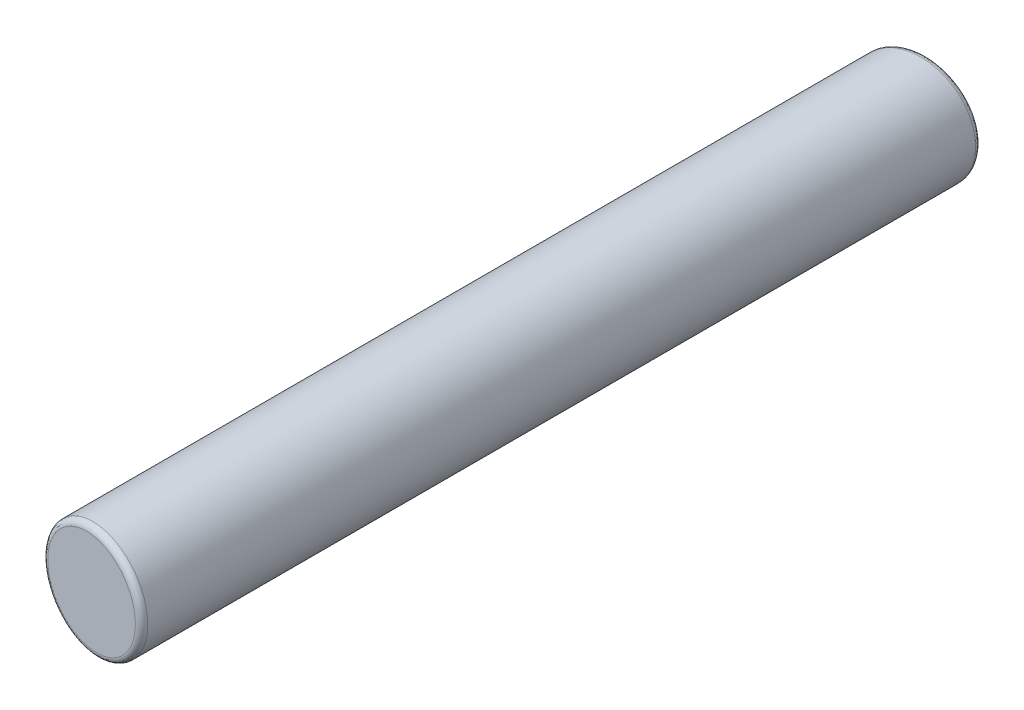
ISO-10303-21;
HEADER;
FILE_DESCRIPTION(('STEP AP214'),'2;1');
FILE_NAME('part.step','',(''),(''),'','','');
FILE_SCHEMA(('AUTOMOTIVE_DESIGN { 1 0 10303 214 1 1 1 1 }'));
ENDSEC;
DATA;
#1=APPLICATION_CONTEXT('core data for automotive mechanical design processes');
#2=APPLICATION_PROTOCOL_DEFINITION('international standard','automotive_design',2000,#1);
#3=PRODUCT_CONTEXT('',#1,'mechanical');
#4=PRODUCT('Part','Part','',(#3));
#5=PRODUCT_RELATED_PRODUCT_CATEGORY('part','',(#4));
#6=PRODUCT_DEFINITION_FORMATION('','',#4);
#7=PRODUCT_DEFINITION_CONTEXT('part definition',#1,'design');
#8=PRODUCT_DEFINITION('design','',#6,#7);
#9=PRODUCT_DEFINITION_SHAPE('','',#8);
#10=(LENGTH_UNIT() NAMED_UNIT(*) SI_UNIT(.MILLI.,.METRE.));
#11=(NAMED_UNIT(*) PLANE_ANGLE_UNIT() SI_UNIT($,.RADIAN.));
#12=(NAMED_UNIT(*) SI_UNIT($,.STERADIAN.) SOLID_ANGLE_UNIT());
#13=UNCERTAINTY_MEASURE_WITH_UNIT(LENGTH_MEASURE(1.E-05),#10,'distance_accuracy_value','');
#14=(GEOMETRIC_REPRESENTATION_CONTEXT(3) GLOBAL_UNCERTAINTY_ASSIGNED_CONTEXT((#13)) GLOBAL_UNIT_ASSIGNED_CONTEXT((#10,
#11,#12)) REPRESENTATION_CONTEXT('',''));
#15=CARTESIAN_POINT('',(0.,0.,0.));
#16=DIRECTION('',(0.,0.,1.));
#17=DIRECTION('',(1.,0.,0.));
#18=AXIS2_PLACEMENT_3D('',#15,#16,#17);
#19=CARTESIAN_POINT('',(0.,0.,18.2372));
#20=DIRECTION('',(0.,0.,-1.));
#21=DIRECTION('',(-1.,0.,0.));
#22=AXIS2_PLACEMENT_3D('',#19,#20,#21);
#23=CYLINDRICAL_SURFACE('',#22,1.2065);
#24=CARTESIAN_POINT('',(0.,0.,17.9641832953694));
#25=DIRECTION('',(-0.106989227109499,0.,0.994260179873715));
#26=DIRECTION('',(-0.994260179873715,0.,-0.106989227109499));
#27=AXIS2_PLACEMENT_3D('',#24,#25,#26);
#28=ELLIPSE('',#27,1.21346507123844,1.2065);
#29=CARTESIAN_POINT('',(-1.2065,0.,17.8343556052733));
#30=VERTEX_POINT('',#29);
#31=EDGE_CURVE('E49',#30,#30,#28,.F.);
#32=ORIENTED_EDGE('',*,*,#31,.T.);
#33=EDGE_LOOP('',(#32));
#34=FACE_BOUND('',#33,.T.);
#35=CARTESIAN_POINT('',(0.,0.,0.267548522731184));
#36=DIRECTION('',(-0.103049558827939,0.,-0.994676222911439));
#37=DIRECTION('',(0.994676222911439,0.,-0.103049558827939));
#38=AXIS2_PLACEMENT_3D('',#35,#36,#37);
#39=ELLIPSE('',#38,1.21295751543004,1.2065);
#40=CARTESIAN_POINT('',(1.2065,0.,0.142553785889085));
#41=VERTEX_POINT('',#40);
#42=EDGE_CURVE('E76',#41,#41,#39,.F.);
#43=ORIENTED_EDGE('',*,*,#42,.T.);
#44=EDGE_LOOP('',(#43));
#45=FACE_BOUND('',#44,.T.);
#46=ADVANCED_FACE('F34',(#34,#45),#23,.T.);
#47=CARTESIAN_POINT('',(1.2065,-63.5,18.2372));
#48=DIRECTION('',(0.119406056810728,0.,-0.992845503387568));
#49=DIRECTION('',(-0.992845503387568,0.,-0.119406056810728));
#50=AXIS2_PLACEMENT_3D('',#47,#48,#49);
#51=PLANE('',#50);
#52=CARTESIAN_POINT('',(-0.0151645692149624,0.,18.0902746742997));
#53=DIRECTION('',(0.119406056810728,0.,-0.992845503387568));
#54=DIRECTION('',(-0.992845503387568,0.,-0.119406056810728));
#55=AXIS2_PLACEMENT_3D('',#52,#53,#54);
#56=ELLIPSE('',#55,1.08727893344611,1.0795);
#57=CARTESIAN_POINT('',(-1.09466456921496,0.,17.9604469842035));
#58=VERTEX_POINT('',#57);
#59=EDGE_CURVE('E44',#58,#58,#56,.F.);
#60=ORIENTED_EDGE('',*,*,#59,.T.);
#61=EDGE_LOOP('',(#60));
#62=FACE_BOUND('',#61,.T.);
#63=ADVANCED_FACE('F59',(#62),#51,.F.);
#64=CARTESIAN_POINT('',(-1.2065,-63.5,0.2794));
#65=DIRECTION('',(0.115020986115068,0.,0.993363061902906));
#66=DIRECTION('',(0.993363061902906,0.,-0.115020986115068));
#67=AXIS2_PLACEMENT_3D('',#64,#65,#66);
#68=PLANE('',#67);
#69=CARTESIAN_POINT('',(-0.0146076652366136,0.,0.141391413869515));
#70=DIRECTION('',(0.115020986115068,0.,0.993363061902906));
#71=DIRECTION('',(0.993363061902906,0.,-0.115020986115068));
#72=AXIS2_PLACEMENT_3D('',#69,#70,#71);
#73=ELLIPSE('',#72,1.08671244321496,1.0795);
#74=CARTESIAN_POINT('',(1.06489233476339,0.,0.0163966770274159));
#75=VERTEX_POINT('',#74);
#76=EDGE_CURVE('E10',#75,#75,#73,.F.);
#77=ORIENTED_EDGE('',*,*,#76,.T.);
#78=EDGE_LOOP('',(#77));
#79=FACE_BOUND('',#78,.T.);
#80=ADVANCED_FACE('F56',(#79),#68,.F.);
#81=CARTESIAN_POINT('',(-1.09466456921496,0.,17.9604469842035));
#82=CARTESIAN_POINT('',(-1.2065,0.,17.9469969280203));
#83=CARTESIAN_POINT('',(-1.2065,0.,17.8343556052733));
#84=CARTESIAN_POINT('',(-1.09466456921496,0.0471039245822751,17.9604469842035));
#85=CARTESIAN_POINT('',(-1.2065,0.0520543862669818,17.9469969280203));
#86=CARTESIAN_POINT('',(-1.2065,0.0526455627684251,17.8343556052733));
#87=CARTESIAN_POINT('',(-1.09157682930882,0.0942078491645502,17.9608183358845));
#88=CARTESIAN_POINT('',(-1.20312469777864,0.104124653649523,17.9474028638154));
#89=CARTESIAN_POINT('',(-1.20304899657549,0.10529112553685,17.8347269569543));
#90=CARTESIAN_POINT('',(-1.0792802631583,0.187609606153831,17.9622972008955));
#91=CARTESIAN_POINT('',(-1.1896880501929,0.207369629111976,17.9490188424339));
#92=CARTESIAN_POINT('',(-1.18930577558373,0.20968132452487,17.8362058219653));
#93=CARTESIAN_POINT('',(-1.07006994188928,0.233907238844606,17.963404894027));
#94=CARTESIAN_POINT('',(-1.17961692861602,0.258574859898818,17.9502300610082));
#95=CARTESIAN_POINT('',(-1.17901188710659,0.261425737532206,17.8373135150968));
#96=CARTESIAN_POINT('',(-1.04568730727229,0.32490453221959,17.9663373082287));
#97=CARTESIAN_POINT('',(-1.15296126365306,0.359241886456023,17.9534358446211));
#98=CARTESIAN_POINT('',(-1.15176070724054,0.363128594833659,17.8402459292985));
#99=CARTESIAN_POINT('',(-1.03051218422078,0.369603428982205,17.9681623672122));
#100=CARTESIAN_POINT('',(-1.13635785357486,0.408730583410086,17.9554326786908));
#101=CARTESIAN_POINT('',(-1.13480027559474,0.413086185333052,17.842070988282));
#102=CARTESIAN_POINT('',(-0.994460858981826,0.456639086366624,17.9724981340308));
#103=CARTESIAN_POINT('',(-1.09691520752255,0.505145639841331,17.9601763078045));
#104=CARTESIAN_POINT('',(-1.09450761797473,0.510361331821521,17.8464067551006));
#105=CARTESIAN_POINT('',(-0.973580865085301,0.498974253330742,17.9750092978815));
#106=CARTESIAN_POINT('',(-1.07404932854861,0.552093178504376,17.962926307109));
#107=CARTESIAN_POINT('',(-1.07117115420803,0.55767710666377,17.8489179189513));
#108=CARTESIAN_POINT('',(-0.926477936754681,0.580558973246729,17.9806742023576));
#109=CARTESIAN_POINT('',(-1.02245975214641,0.64264847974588,17.9691308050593));
#110=CARTESIAN_POINT('',(-1.01852670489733,0.648860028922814,17.8545828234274));
#111=CARTESIAN_POINT('',(-0.900250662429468,0.619805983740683,17.9838284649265));
#112=CARTESIAN_POINT('',(-0.9937034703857,0.686270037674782,17.9725892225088));
#113=CARTESIAN_POINT('',(-0.9892138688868,0.692724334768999,17.8577370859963));
#114=CARTESIAN_POINT('',(-0.842902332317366,0.694543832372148,17.9907255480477));
#115=CARTESIAN_POINT('',(-0.930805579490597,0.769449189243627,17.9801537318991));
#116=CARTESIAN_POINT('',(-0.925118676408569,0.776254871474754,17.8646341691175));
#117=CARTESIAN_POINT('',(-0.811776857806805,0.730031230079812,17.9944689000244));
#118=CARTESIAN_POINT('',(-0.896627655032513,0.809012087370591,17.9842641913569));
#119=CARTESIAN_POINT('',(-0.890331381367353,0.815917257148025,17.8683775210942));
#120=CARTESIAN_POINT('',(-0.745164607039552,0.796643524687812,18.0024801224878));
#121=CARTESIAN_POINT('',(-0.82344627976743,0.883413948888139,17.993065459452));
#122=CARTESIAN_POINT('',(-0.815882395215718,0.890366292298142,17.8763887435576));
#123=CARTESIAN_POINT('',(-0.709673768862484,0.827764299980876,18.0067484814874));
#124=CARTESIAN_POINT('',(-0.784405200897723,0.918249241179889,17.9977607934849));
#125=CARTESIAN_POINT('',(-0.776216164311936,0.925148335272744,17.8806571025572));
#126=CARTESIAN_POINT('',(-0.634937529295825,0.885111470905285,18.015736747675));
#127=CARTESIAN_POINT('',(-0.702136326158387,0.982610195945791,18.0076549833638));
#128=CARTESIAN_POINT('',(-0.692687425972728,0.98924223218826,17.8896453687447));
#129=CARTESIAN_POINT('',(-0.595688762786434,0.911333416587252,18.020457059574));
#130=CARTESIAN_POINT('',(-0.658872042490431,1.01212336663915,18.0128582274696));
#131=CARTESIAN_POINT('',(-0.648821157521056,1.01854911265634,17.8943656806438));
#132=CARTESIAN_POINT('',(-0.514107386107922,0.958434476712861,18.0302685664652));
#133=CARTESIAN_POINT('',(-0.568865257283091,1.06533773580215,18.0236830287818));
#134=CARTESIAN_POINT('',(-0.557641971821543,1.0711914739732,17.904177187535));
#135=CARTESIAN_POINT('',(-0.471772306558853,0.979309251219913,18.035360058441));
#136=CARTESIAN_POINT('',(-0.522089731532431,1.08901838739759,18.0293085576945));
#137=CARTESIAN_POINT('',(-0.510326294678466,1.09452210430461,17.9092686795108));
#138=CARTESIAN_POINT('',(-0.384741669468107,1.01535854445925,18.0458269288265));
#139=CARTESIAN_POINT('',(-0.425828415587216,1.13015676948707,18.040885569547));
#140=CARTESIAN_POINT('',(-0.413056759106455,1.13481249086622,17.9197355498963));
#141=CARTESIAN_POINT('',(-0.340044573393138,1.03052929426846,18.0512024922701));
#142=CARTESIAN_POINT('',(-0.376315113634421,1.14758720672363,18.0468403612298));
#143=CARTESIAN_POINT('',(-0.363101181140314,1.15176803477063,17.9251111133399));
#144=CARTESIAN_POINT('',(-0.249053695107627,1.05491024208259,18.0621456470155));
#145=CARTESIAN_POINT('',(-0.275394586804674,1.17591256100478,18.0589777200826));
#146=CARTESIAN_POINT('',(-0.261405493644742,1.17901732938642,17.9360542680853));
#147=CARTESIAN_POINT('',(-0.202759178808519,1.0641176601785,18.0677133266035));
#148=CARTESIAN_POINT('',(-0.223967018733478,1.18677519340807,18.0651627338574));
#149=CARTESIAN_POINT('',(-0.209664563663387,1.18930797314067,17.9416219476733));
#150=CARTESIAN_POINT('',(-0.109364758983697,1.0764132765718,18.0789455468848));
#151=CARTESIAN_POINT('',(-0.120070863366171,1.20175651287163,18.0776579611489));
#152=CARTESIAN_POINT('',(-0.105282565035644,1.20305013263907,17.9528541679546));
#153=CARTESIAN_POINT('',(-0.0622646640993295,1.0795,18.0846101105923));
#154=CARTESIAN_POINT('',(-0.0675902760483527,1.20584000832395,18.0839696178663));
#155=CARTESIAN_POINT('',(-0.0526412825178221,1.2065,17.958518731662));
#156=CARTESIAN_POINT('',(0.0319355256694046,1.0795,18.0959392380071));
#157=CARTESIAN_POINT('',(0.0375349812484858,1.20716343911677,18.0966126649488));
#158=CARTESIAN_POINT('',(0.0526412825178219,1.2065,17.9698478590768));
#159=CARTESIAN_POINT('',(0.0790356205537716,1.0764132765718,18.1016038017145));
#160=CARTESIAN_POINT('',(0.0901826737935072,1.20436756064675,18.1029444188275));
#161=CARTESIAN_POINT('',(0.105282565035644,1.20305013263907,17.9755124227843));
#162=CARTESIAN_POINT('',(0.172430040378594,1.0641176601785,18.1128360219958));
#163=CARTESIAN_POINT('',(0.194754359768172,1.19194481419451,18.1155208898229));
#164=CARTESIAN_POINT('',(0.209664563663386,1.18930797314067,17.9867446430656));
#165=CARTESIAN_POINT('',(0.218724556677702,1.05491024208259,18.1184037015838));
#166=CARTESIAN_POINT('',(0.246672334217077,1.18228385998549,18.1217648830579));
#167=CARTESIAN_POINT('',(0.261405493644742,1.17901732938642,17.9923123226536));
#168=CARTESIAN_POINT('',(0.309715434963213,1.03052929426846,18.1293468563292));
#169=CARTESIAN_POINT('',(0.348899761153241,1.15625772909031,18.1340594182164));
#170=CARTESIAN_POINT('',(0.363101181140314,1.15176803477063,18.003255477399));
#171=CARTESIAN_POINT('',(0.354412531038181,1.01535854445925,18.1347224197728));
#172=CARTESIAN_POINT('',(0.399194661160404,1.13986247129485,18.140108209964));
#173=CARTESIAN_POINT('',(0.413056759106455,1.13481249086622,18.0086310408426));
#174=CARTESIAN_POINT('',(0.441443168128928,0.979309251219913,18.1451892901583));
#175=CARTESIAN_POINT('',(0.497308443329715,1.10060920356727,18.1519080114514));
#176=CARTESIAN_POINT('',(0.510326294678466,1.09452210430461,18.0190979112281));
#177=CARTESIAN_POINT('',(0.483778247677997,0.958434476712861,18.1502807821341));
#178=CARTESIAN_POINT('',(0.545105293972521,1.07772718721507,18.1576563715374));
#179=CARTESIAN_POINT('',(0.557641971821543,1.0711914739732,18.0241894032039));
#180=CARTESIAN_POINT('',(0.565359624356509,0.911333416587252,18.1600922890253));
#181=CARTESIAN_POINT('',(0.637387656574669,1.02585539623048,18.1687548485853));
#182=CARTESIAN_POINT('',(0.648821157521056,1.01854911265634,18.0340009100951));
#183=CARTESIAN_POINT('',(0.6046083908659,0.885111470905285,18.1648126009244));
#184=CARTESIAN_POINT('',(0.681845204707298,0.996849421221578,18.1741016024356));
#185=CARTESIAN_POINT('',(0.692687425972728,0.98924223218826,18.0387212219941));
#186=CARTESIAN_POINT('',(0.679344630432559,0.827764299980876,18.1738008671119));
#187=CARTESIAN_POINT('',(0.766661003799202,0.933195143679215,18.184302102));
#188=CARTESIAN_POINT('',(0.776216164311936,0.925148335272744,18.0477094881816));
#189=CARTESIAN_POINT('',(0.714835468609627,0.796643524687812,18.1780692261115));
#190=CARTESIAN_POINT('',(0.806987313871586,0.898539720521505,18.1891520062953));
#191=CARTESIAN_POINT('',(0.815882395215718,0.890366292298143,18.0519778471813));
#192=CARTESIAN_POINT('',(0.78144771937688,0.730031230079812,18.1860804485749));
#193=CARTESIAN_POINT('',(0.882815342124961,0.824157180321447,18.1982715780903));
#194=CARTESIAN_POINT('',(0.890331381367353,0.815917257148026,18.0599890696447));
#195=CARTESIAN_POINT('',(0.812573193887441,0.694543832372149,18.1898238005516));
#196=CARTESIAN_POINT('',(0.918283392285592,0.784432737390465,18.2025371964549));
#197=CARTESIAN_POINT('',(0.925118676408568,0.776254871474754,18.0637324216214));
#198=CARTESIAN_POINT('',(0.869921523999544,0.619805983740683,18.1967208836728));
#199=CARTESIAN_POINT('',(0.983747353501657,0.700580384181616,18.2104103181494));
#200=CARTESIAN_POINT('',(0.9892138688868,0.692724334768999,18.0706295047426));
#201=CARTESIAN_POINT('',(0.896148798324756,0.580558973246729,18.1998751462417));
#202=CARTESIAN_POINT('',(1.01371027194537,0.656465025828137,18.2140138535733));
#203=CARTESIAN_POINT('',(1.01852670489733,0.648860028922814,18.0737837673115));
#204=CARTESIAN_POINT('',(0.943251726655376,0.498974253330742,18.2055400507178));
#205=CARTESIAN_POINT('',(1.06760858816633,0.564586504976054,18.2204960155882));
#206=CARTESIAN_POINT('',(1.07117115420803,0.55767710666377,18.0794486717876));
#207=CARTESIAN_POINT('',(0.964131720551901,0.456639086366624,18.2080512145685));
#208=CARTESIAN_POINT('',(1.09151405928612,0.516845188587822,18.2233710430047));
#209=CARTESIAN_POINT('',(1.09450761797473,0.510361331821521,18.0819598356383));
#210=CARTESIAN_POINT('',(1.00018304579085,0.369603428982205,18.2123869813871));
#211=CARTESIAN_POINT('',(1.13284746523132,0.418545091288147,18.2283420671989));
#212=CARTESIAN_POINT('',(1.13480027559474,0.413086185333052,18.0862956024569));
#213=CARTESIAN_POINT('',(1.01535816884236,0.32490453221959,18.2142120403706));
#214=CARTESIAN_POINT('',(1.15025074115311,0.368016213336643,18.2304350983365));
#215=CARTESIAN_POINT('',(1.15176070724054,0.363128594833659,18.0881206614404));
#216=CARTESIAN_POINT('',(1.03974080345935,0.233907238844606,18.2171444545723));
#217=CARTESIAN_POINT('',(1.17824647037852,0.265030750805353,18.2338020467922));
#218=CARTESIAN_POINT('',(1.17901188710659,0.261425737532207,18.0910530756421));
#219=CARTESIAN_POINT('',(1.04895112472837,0.187609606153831,18.2182521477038));
#220=CARTESIAN_POINT('',(1.18882137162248,0.212610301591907,18.2350738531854));
#221=CARTESIAN_POINT('',(1.18930577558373,0.20968132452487,18.0921607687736));
#222=CARTESIAN_POINT('',(1.0612476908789,0.0942078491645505,18.2197310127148));
#223=CARTESIAN_POINT('',(1.20295269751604,0.1067734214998,18.2367733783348));
#224=CARTESIAN_POINT('',(1.20304899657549,0.105291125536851,18.0936396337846));
#225=CARTESIAN_POINT('',(1.06433543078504,0.0471039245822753,18.2201023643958));
#226=CARTESIAN_POINT('',(1.2065,0.0533970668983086,18.2372));
#227=CARTESIAN_POINT('',(1.2065,0.0526455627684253,18.0940109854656));
#228=CARTESIAN_POINT('',(1.06433543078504,-0.047103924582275,18.2201023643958));
#229=CARTESIAN_POINT('',(1.2065,-0.0533970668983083,18.2372));
#230=CARTESIAN_POINT('',(1.2065,-0.052645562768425,18.0940109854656));
#231=CARTESIAN_POINT('',(1.0612476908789,-0.0942078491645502,18.2197310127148));
#232=CARTESIAN_POINT('',(1.20295269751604,-0.1067734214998,18.2367733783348));
#233=CARTESIAN_POINT('',(1.20304899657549,-0.10529112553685,18.0936396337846));
#234=CARTESIAN_POINT('',(1.04895112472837,-0.187609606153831,18.2182521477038));
#235=CARTESIAN_POINT('',(1.18882137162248,-0.212610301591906,18.2350738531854));
#236=CARTESIAN_POINT('',(1.18930577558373,-0.20968132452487,18.0921607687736));
#237=CARTESIAN_POINT('',(1.03974080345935,-0.233907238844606,18.2171444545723));
#238=CARTESIAN_POINT('',(1.17824647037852,-0.265030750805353,18.2338020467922));
#239=CARTESIAN_POINT('',(1.17901188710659,-0.261425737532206,18.0910530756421));
#240=CARTESIAN_POINT('',(1.01535816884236,-0.32490453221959,18.2142120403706));
#241=CARTESIAN_POINT('',(1.15025074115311,-0.368016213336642,18.2304350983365));
#242=CARTESIAN_POINT('',(1.15176070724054,-0.363128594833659,18.0881206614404));
#243=CARTESIAN_POINT('',(1.00018304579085,-0.369603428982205,18.2123869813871));
#244=CARTESIAN_POINT('',(1.13284746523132,-0.418545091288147,18.2283420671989));
#245=CARTESIAN_POINT('',(1.13480027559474,-0.413086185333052,18.0862956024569));
#246=CARTESIAN_POINT('',(0.964131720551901,-0.456639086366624,18.2080512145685));
#247=CARTESIAN_POINT('',(1.09151405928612,-0.516845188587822,18.2233710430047));
#248=CARTESIAN_POINT('',(1.09450761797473,-0.510361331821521,18.0819598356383));
#249=CARTESIAN_POINT('',(0.943251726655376,-0.498974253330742,18.2055400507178));
#250=CARTESIAN_POINT('',(1.06760858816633,-0.564586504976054,18.2204960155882));
#251=CARTESIAN_POINT('',(1.07117115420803,-0.55767710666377,18.0794486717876));
#252=CARTESIAN_POINT('',(0.896148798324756,-0.580558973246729,18.1998751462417));
#253=CARTESIAN_POINT('',(1.01371027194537,-0.656465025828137,18.2140138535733));
#254=CARTESIAN_POINT('',(1.01852670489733,-0.648860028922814,18.0737837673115));
#255=CARTESIAN_POINT('',(0.869921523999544,-0.619805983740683,18.1967208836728));
#256=CARTESIAN_POINT('',(0.983747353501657,-0.700580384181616,18.2104103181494));
#257=CARTESIAN_POINT('',(0.9892138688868,-0.692724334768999,18.0706295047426));
#258=CARTESIAN_POINT('',(0.812573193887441,-0.694543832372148,18.1898238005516));
#259=CARTESIAN_POINT('',(0.918283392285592,-0.784432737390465,18.2025371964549));
#260=CARTESIAN_POINT('',(0.925118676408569,-0.776254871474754,18.0637324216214));
#261=CARTESIAN_POINT('',(0.78144771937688,-0.730031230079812,18.1860804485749));
#262=CARTESIAN_POINT('',(0.882815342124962,-0.824157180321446,18.1982715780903));
#263=CARTESIAN_POINT('',(0.890331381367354,-0.815917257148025,18.0599890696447));
#264=CARTESIAN_POINT('',(0.714835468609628,-0.796643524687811,18.1780692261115));
#265=CARTESIAN_POINT('',(0.806987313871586,-0.898539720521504,18.1891520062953));
#266=CARTESIAN_POINT('',(0.815882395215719,-0.890366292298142,18.0519778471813));
#267=CARTESIAN_POINT('',(0.67934463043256,-0.827764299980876,18.1738008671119));
#268=CARTESIAN_POINT('',(0.766661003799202,-0.933195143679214,18.184302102));
#269=CARTESIAN_POINT('',(0.776216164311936,-0.925148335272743,18.0477094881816));
#270=CARTESIAN_POINT('',(0.6046083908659,-0.885111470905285,18.1648126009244));
#271=CARTESIAN_POINT('',(0.681845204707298,-0.996849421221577,18.1741016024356));
#272=CARTESIAN_POINT('',(0.692687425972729,-0.98924223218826,18.0387212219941));
#273=CARTESIAN_POINT('',(0.565359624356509,-0.911333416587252,18.1600922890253));
#274=CARTESIAN_POINT('',(0.637387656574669,-1.02585539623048,18.1687548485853));
#275=CARTESIAN_POINT('',(0.648821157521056,-1.01854911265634,18.0340009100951));
#276=CARTESIAN_POINT('',(0.483778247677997,-0.958434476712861,18.1502807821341));
#277=CARTESIAN_POINT('',(0.545105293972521,-1.07772718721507,18.1576563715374));
#278=CARTESIAN_POINT('',(0.557641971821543,-1.0711914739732,18.0241894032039));
#279=CARTESIAN_POINT('',(0.441443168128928,-0.979309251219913,18.1451892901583));
#280=CARTESIAN_POINT('',(0.497308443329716,-1.10060920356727,18.1519080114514));
#281=CARTESIAN_POINT('',(0.510326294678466,-1.09452210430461,18.0190979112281));
#282=CARTESIAN_POINT('',(0.354412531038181,-1.01535854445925,18.1347224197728));
#283=CARTESIAN_POINT('',(0.399194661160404,-1.13986247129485,18.140108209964));
#284=CARTESIAN_POINT('',(0.413056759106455,-1.13481249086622,18.0086310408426));
#285=CARTESIAN_POINT('',(0.309715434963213,-1.03052929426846,18.1293468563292));
#286=CARTESIAN_POINT('',(0.348899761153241,-1.15625772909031,18.1340594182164));
#287=CARTESIAN_POINT('',(0.363101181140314,-1.15176803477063,18.003255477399));
#288=CARTESIAN_POINT('',(0.218724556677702,-1.05491024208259,18.1184037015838));
#289=CARTESIAN_POINT('',(0.246672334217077,-1.18228385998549,18.1217648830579));
#290=CARTESIAN_POINT('',(0.261405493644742,-1.17901732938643,17.9923123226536));
#291=CARTESIAN_POINT('',(0.172430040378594,-1.0641176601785,18.1128360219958));
#292=CARTESIAN_POINT('',(0.194754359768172,-1.19194481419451,18.1155208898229));
#293=CARTESIAN_POINT('',(0.209664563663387,-1.18930797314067,17.9867446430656));
#294=CARTESIAN_POINT('',(0.0790356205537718,-1.0764132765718,18.1016038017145));
#295=CARTESIAN_POINT('',(0.0901826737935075,-1.20436756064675,18.1029444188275));
#296=CARTESIAN_POINT('',(0.105282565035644,-1.20305013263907,17.9755124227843));
#297=CARTESIAN_POINT('',(0.0319355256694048,-1.0795,18.0959392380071));
#298=CARTESIAN_POINT('',(0.037534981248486,-1.20716343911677,18.0966126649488));
#299=CARTESIAN_POINT('',(0.0526412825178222,-1.2065,17.9698478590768));
#300=CARTESIAN_POINT('',(-0.0622646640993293,-1.0795,18.0846101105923));
#301=CARTESIAN_POINT('',(-0.0675902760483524,-1.20584000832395,18.0839696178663));
#302=CARTESIAN_POINT('',(-0.0526412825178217,-1.2065,17.958518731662));
#303=CARTESIAN_POINT('',(-0.109364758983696,-1.0764132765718,18.0789455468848));
#304=CARTESIAN_POINT('',(-0.12007086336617,-1.20175651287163,18.0776579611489));
#305=CARTESIAN_POINT('',(-0.105282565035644,-1.20305013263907,17.9528541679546));
#306=CARTESIAN_POINT('',(-0.202759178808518,-1.0641176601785,18.0677133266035));
#307=CARTESIAN_POINT('',(-0.223967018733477,-1.18677519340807,18.0651627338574));
#308=CARTESIAN_POINT('',(-0.209664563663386,-1.18930797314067,17.9416219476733));
#309=CARTESIAN_POINT('',(-0.249053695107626,-1.05491024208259,18.0621456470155));
#310=CARTESIAN_POINT('',(-0.275394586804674,-1.17591256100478,18.0589777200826));
#311=CARTESIAN_POINT('',(-0.261405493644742,-1.17901732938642,17.9360542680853));
#312=CARTESIAN_POINT('',(-0.340044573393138,-1.03052929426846,18.0512024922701));
#313=CARTESIAN_POINT('',(-0.37631511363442,-1.14758720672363,18.0468403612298));
#314=CARTESIAN_POINT('',(-0.363101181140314,-1.15176803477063,17.9251111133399));
#315=CARTESIAN_POINT('',(-0.384741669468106,-1.01535854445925,18.0458269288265));
#316=CARTESIAN_POINT('',(-0.425828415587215,-1.13015676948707,18.040885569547));
#317=CARTESIAN_POINT('',(-0.413056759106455,-1.13481249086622,17.9197355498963));
#318=CARTESIAN_POINT('',(-0.471772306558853,-0.979309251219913,18.035360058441));
#319=CARTESIAN_POINT('',(-0.52208973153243,-1.08901838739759,18.0293085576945));
#320=CARTESIAN_POINT('',(-0.510326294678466,-1.09452210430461,17.9092686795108));
#321=CARTESIAN_POINT('',(-0.514107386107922,-0.958434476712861,18.0302685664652));
#322=CARTESIAN_POINT('',(-0.568865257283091,-1.06533773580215,18.0236830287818));
#323=CARTESIAN_POINT('',(-0.557641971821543,-1.0711914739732,17.904177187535));
#324=CARTESIAN_POINT('',(-0.595688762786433,-0.911333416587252,18.020457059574));
#325=CARTESIAN_POINT('',(-0.65887204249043,-1.01212336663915,18.0128582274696));
#326=CARTESIAN_POINT('',(-0.648821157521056,-1.01854911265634,17.8943656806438));
#327=CARTESIAN_POINT('',(-0.634937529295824,-0.885111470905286,18.015736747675));
#328=CARTESIAN_POINT('',(-0.702136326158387,-0.982610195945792,18.0076549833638));
#329=CARTESIAN_POINT('',(-0.692687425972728,-0.98924223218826,17.8896453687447));
#330=CARTESIAN_POINT('',(-0.709673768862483,-0.827764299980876,18.0067484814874));
#331=CARTESIAN_POINT('',(-0.784405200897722,-0.91824924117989,17.9977607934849));
#332=CARTESIAN_POINT('',(-0.776216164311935,-0.925148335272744,17.8806571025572));
#333=CARTESIAN_POINT('',(-0.745164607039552,-0.796643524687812,18.0024801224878));
#334=CARTESIAN_POINT('',(-0.823446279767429,-0.883413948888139,17.993065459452));
#335=CARTESIAN_POINT('',(-0.815882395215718,-0.890366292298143,17.8763887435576));
#336=CARTESIAN_POINT('',(-0.811776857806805,-0.730031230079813,17.9944689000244));
#337=CARTESIAN_POINT('',(-0.896627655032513,-0.809012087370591,17.9842641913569));
#338=CARTESIAN_POINT('',(-0.890331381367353,-0.815917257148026,17.8683775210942));
#339=CARTESIAN_POINT('',(-0.842902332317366,-0.694543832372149,17.9907255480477));
#340=CARTESIAN_POINT('',(-0.930805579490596,-0.769449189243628,17.9801537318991));
#341=CARTESIAN_POINT('',(-0.925118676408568,-0.776254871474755,17.8646341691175));
#342=CARTESIAN_POINT('',(-0.900250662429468,-0.619805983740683,17.9838284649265));
#343=CARTESIAN_POINT('',(-0.993703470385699,-0.686270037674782,17.9725892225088));
#344=CARTESIAN_POINT('',(-0.9892138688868,-0.692724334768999,17.8577370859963));
#345=CARTESIAN_POINT('',(-0.92647793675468,-0.580558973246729,17.9806742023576));
#346=CARTESIAN_POINT('',(-1.02245975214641,-0.64264847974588,17.9691308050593));
#347=CARTESIAN_POINT('',(-1.01852670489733,-0.648860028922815,17.8545828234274));
#348=CARTESIAN_POINT('',(-0.973580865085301,-0.498974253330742,17.9750092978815));
#349=CARTESIAN_POINT('',(-1.07404932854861,-0.552093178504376,17.962926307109));
#350=CARTESIAN_POINT('',(-1.07117115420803,-0.557677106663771,17.8489179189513));
#351=CARTESIAN_POINT('',(-0.994460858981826,-0.456639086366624,17.9724981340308));
#352=CARTESIAN_POINT('',(-1.09691520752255,-0.505145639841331,17.9601763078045));
#353=CARTESIAN_POINT('',(-1.09450761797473,-0.510361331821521,17.8464067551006));
#354=CARTESIAN_POINT('',(-1.03051218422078,-0.369603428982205,17.9681623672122));
#355=CARTESIAN_POINT('',(-1.13635785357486,-0.408730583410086,17.9554326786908));
#356=CARTESIAN_POINT('',(-1.13480027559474,-0.413086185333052,17.842070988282));
#357=CARTESIAN_POINT('',(-1.04568730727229,-0.32490453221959,17.9663373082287));
#358=CARTESIAN_POINT('',(-1.15296126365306,-0.359241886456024,17.9534358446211));
#359=CARTESIAN_POINT('',(-1.15176070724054,-0.363128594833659,17.8402459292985));
#360=CARTESIAN_POINT('',(-1.07006994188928,-0.233907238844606,17.963404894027));
#361=CARTESIAN_POINT('',(-1.17961692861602,-0.258574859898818,17.9502300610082));
#362=CARTESIAN_POINT('',(-1.17901188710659,-0.261425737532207,17.8373135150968));
#363=CARTESIAN_POINT('',(-1.0792802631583,-0.187609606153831,17.9622972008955));
#364=CARTESIAN_POINT('',(-1.1896880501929,-0.207369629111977,17.9490188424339));
#365=CARTESIAN_POINT('',(-1.18930577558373,-0.20968132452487,17.8362058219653));
#366=CARTESIAN_POINT('',(-1.09157682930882,-0.0942078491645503,17.9608183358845));
#367=CARTESIAN_POINT('',(-1.20312469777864,-0.104124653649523,17.9474028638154));
#368=CARTESIAN_POINT('',(-1.20304899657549,-0.10529112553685,17.8347269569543));
#369=CARTESIAN_POINT('',(-1.09466456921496,-0.0471039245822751,17.9604469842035));
#370=CARTESIAN_POINT('',(-1.2065,-0.0520543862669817,17.9469969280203));
#371=CARTESIAN_POINT('',(-1.2065,-0.0526455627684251,17.8343556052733));
#372=CARTESIAN_POINT('',(-1.09466456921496,0.,17.9604469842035));
#373=CARTESIAN_POINT('',(-1.2065,0.,17.9469969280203));
#374=CARTESIAN_POINT('',(-1.2065,0.,17.8343556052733));
#375=(BOUNDED_SURFACE() B_SPLINE_SURFACE(3,2,((#81,#82,#83),(#84,#85,#86),(#87,#88,#89),(#90,
#91,#92),(#93,#94,#95),(#96,#97,#98),(#99,#100,#101),(#102,#103,#104),(#105,#106,#107),(#108,
#109,#110),(#111,#112,#113),(#114,#115,#116),(#117,#118,#119),(#120,#121,#122),(#123,#124,#125),
(#126,#127,#128),(#129,#130,#131),(#132,#133,#134),(#135,#136,#137),(#138,#139,#140),(#141,#142,
#143),(#144,#145,#146),(#147,#148,#149),(#150,#151,#152),(#153,#154,#155),(#156,#157,#158),
(#159,#160,#161),(#162,#163,#164),(#165,#166,#167),(#168,#169,#170),(#171,#172,#173),(#174,#175,
#176),(#177,#178,#179),(#180,#181,#182),(#183,#184,#185),(#186,#187,#188),(#189,#190,#191),
(#192,#193,#194),(#195,#196,#197),(#198,#199,#200),(#201,#202,#203),(#204,#205,#206),(#207,#208,
#209),(#210,#211,#212),(#213,#214,#215),(#216,#217,#218),(#219,#220,#221),(#222,#223,#224),
(#225,#226,#227),(#228,#229,#230),(#231,#232,#233),(#234,#235,#236),(#237,#238,#239),(#240,#241,
#242),(#243,#244,#245),(#246,#247,#248),(#249,#250,#251),(#252,#253,#254),(#255,#256,#257),
(#258,#259,#260),(#261,#262,#263),(#264,#265,#266),(#267,#268,#269),(#270,#271,#272),(#273,#274,
#275),(#276,#277,#278),(#279,#280,#281),(#282,#283,#284),(#285,#286,#287),(#288,#289,#290),
(#291,#292,#293),(#294,#295,#296),(#297,#298,#299),(#300,#301,#302),(#303,#304,#305),(#306,#307,
#308),(#309,#310,#311),(#312,#313,#314),(#315,#316,#317),(#318,#319,#320),(#321,#322,#323),
(#324,#325,#326),(#327,#328,#329),(#330,#331,#332),(#333,#334,#335),(#336,#337,#338),(#339,#340,
#341),(#342,#343,#344),(#345,#346,#347),(#348,#349,#350),(#351,#352,#353),(#354,#355,#356),
(#357,#358,#359),(#360,#361,#362),(#363,#364,#365),(#366,#367,#368),(#369,#370,#371),(#372,#373,
#374)),.UNSPECIFIED.,.T.,.F.,.F.) B_SPLINE_SURFACE_WITH_KNOTS((4,2,2,2,2,2,2,2,2,2,2,2,2,2,2,2,
2,2,2,2,2,2,2,2,2,2,2,2,2,2,2,2,2,2,2,2,2,2,2,2,2,2,2,2,2,2,2,2,4),(3,3),(0.,0.141209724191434,
0.282453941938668,0.423764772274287,0.565169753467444,0.706689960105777,0.848338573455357,
0.990120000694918,1.13202959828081,1.2740540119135,1.41617210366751,1.55835639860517,
1.70057495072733,1.8427935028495,1.98497779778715,2.12709588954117,2.26912030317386,
2.41102990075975,2.55281132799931,2.69445994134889,2.83598014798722,2.97738512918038,
3.118695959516,3.25994017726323,3.40114990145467,3.5423596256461,3.68360384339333,
3.82491467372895,3.96631965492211,4.10783986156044,4.24948847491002,4.39126990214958,
4.53317949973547,4.67520391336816,4.81732200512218,4.95950630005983,5.101724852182,
5.24394340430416,5.38612769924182,5.52824579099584,5.67027020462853,5.81217980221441,
5.95396122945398,6.09560984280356,6.23713004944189,6.37853503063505,6.51984586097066,
6.6610900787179,6.80229980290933),(0.,1.),
.UNSPECIFIED.) GEOMETRIC_REPRESENTATION_ITEM() RATIONAL_B_SPLINE_SURFACE(((1.,0.748133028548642,
1.),(1.,0.748133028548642,1.),(1.,0.748018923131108,1.),(1.,0.747564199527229,1.),(1.,
0.747223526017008,1.),(1.,0.746320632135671,1.),(1.,0.745758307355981,1.),(1.,0.744420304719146,
1.),(1.,0.743644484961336,1.),(1.,0.741890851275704,1.),(1.,0.740912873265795,1.),(1.,
0.738769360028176,1.),(1.,0.737603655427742,1.),(1.,0.735102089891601,1.),(1.,0.733766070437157,
1.),(1.,0.730944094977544,1.),(1.,0.729458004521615,1.),(1.,0.726358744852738,1.),(1.,
0.724745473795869,1.),(1.,0.721417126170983,1.),(1.,0.719701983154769,1.),(1.,0.716197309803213,
1.),(1.,0.714407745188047,1.),(1.,0.710783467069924,1.),(1.,0.708948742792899,1.),(1.,
0.705264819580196,1.),(1.,0.703415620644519,1.),(1.,0.699734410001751,1.),(1.,0.697902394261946,
1.),(1.,0.694287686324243,1.),(1.,0.692504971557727,1.),(1.,0.68902090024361,1.),(1.,
0.687319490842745,1.),(1.,0.684029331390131,1.),(1.,0.682440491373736,1.),(1.,0.67940536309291,
1.),(1.,0.677958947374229,1.),(1.,0.67523645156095,1.),(1.,0.673960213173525,1.),(1.,
0.671603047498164,1.),(1.,0.6705219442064,1.),(1.,0.66857654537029,1.),(1.,0.667712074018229,
1.),(1.,0.666217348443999,1.),(1.,0.665586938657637,1.),(1.,0.664573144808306,1.),(1.,
0.664189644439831,1.),(1.,0.663677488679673,1.),(1.,0.663548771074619,1.),(1.,0.663548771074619,
1.),(1.,0.663677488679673,1.),(1.,0.664189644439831,1.),(1.,0.664573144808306,1.),(1.,
0.665586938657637,1.),(1.,0.666217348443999,1.),(1.,0.667712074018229,1.),(1.,0.66857654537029,
1.),(1.,0.6705219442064,1.),(1.,0.671603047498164,1.),(1.,0.673960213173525,1.),(1.,
0.67523645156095,1.),(1.,0.677958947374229,1.),(1.,0.67940536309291,1.),(1.,0.682440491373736,
1.),(1.,0.684029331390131,1.),(1.,0.687319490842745,1.),(1.,0.68902090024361,1.),(1.,
0.692504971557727,1.),(1.,0.694287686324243,1.),(1.,0.697902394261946,1.),(1.,0.699734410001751,
1.),(1.,0.703415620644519,1.),(1.,0.705264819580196,1.),(1.,0.708948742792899,1.),(1.,
0.710783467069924,1.),(1.,0.714407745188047,1.),(1.,0.716197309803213,1.),(1.,0.719701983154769,
1.),(1.,0.721417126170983,1.),(1.,0.724745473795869,1.),(1.,0.726358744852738,1.),(1.,
0.729458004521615,1.),(1.,0.730944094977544,1.),(1.,0.733766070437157,1.),(1.,0.735102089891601,
1.),(1.,0.737603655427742,1.),(1.,0.738769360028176,1.),(1.,0.740912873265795,1.),(1.,
0.741890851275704,1.),(1.,0.743644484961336,1.),(1.,0.744420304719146,1.),(1.,0.745758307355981,
1.),(1.,0.746320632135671,1.),(1.,0.747223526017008,1.),(1.,0.747564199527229,1.),(1.,
0.748018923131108,1.),(1.,0.748133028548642,1.),(1.,0.748133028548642,1.))) REPRESENTATION_ITEM('') SURFACE());
#376=CARTESIAN_POINT('',(-1.0795,0.,17.8343556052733));
#377=DIRECTION('',(0.,-1.,0.));
#378=DIRECTION('',(-0.119406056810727,0.,0.992845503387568));
#379=AXIS2_PLACEMENT_3D('',#376,#377,#378);
#380=CIRCLE('',#379,0.127);
#381=EDGE_CURVE('',#58,#30,#380,.T.);
#382=ORIENTED_EDGE('',*,*,#59,.F.);
#383=ORIENTED_EDGE('',*,*,#31,.F.);
#384=ORIENTED_EDGE('',*,*,#381,.T.);
#385=ORIENTED_EDGE('',*,*,#381,.F.);
#386=EDGE_LOOP('',(#382,#384,#383,#385));
#387=FACE_BOUND('',#386,.T.);
#388=ADVANCED_FACE('F53',(#387),#375,.T.);
#389=CARTESIAN_POINT('',(1.06489233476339,0.,0.0163966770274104));
#390=CARTESIAN_POINT('',(1.2065,0.,0.));
#391=CARTESIAN_POINT('',(1.2065,0.,0.142553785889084));
#392=CARTESIAN_POINT('',(1.06489233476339,0.0471037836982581,0.0163966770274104));
#393=CARTESIAN_POINT('',(1.2065,0.0533657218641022,0.));
#394=CARTESIAN_POINT('',(1.2065,0.0526454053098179,0.142553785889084));
#395=CARTESIAN_POINT('',(1.06180463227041,0.0942075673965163,0.0167542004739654));
#396=CARTESIAN_POINT('',(1.20295673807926,0.106711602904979,0.000410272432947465));
#397=CARTESIAN_POINT('',(1.20304903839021,0.105290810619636,0.142911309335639));
#398=CARTESIAN_POINT('',(1.04950810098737,0.187609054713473,0.0181780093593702));
#399=CARTESIAN_POINT('',(1.18884152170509,0.212488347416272,0.0020446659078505));
#400=CARTESIAN_POINT('',(1.18930585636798,0.209680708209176,0.144335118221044));
#401=CARTESIAN_POINT('',(1.04029788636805,0.233906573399,0.0192444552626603));
#402=CARTESIAN_POINT('',(1.1782783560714,0.264880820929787,0.00326776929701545));
#403=CARTESIAN_POINT('',(1.17901208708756,0.261424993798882,0.145401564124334));
#404=CARTESIAN_POINT('',(1.01591531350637,0.324903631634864,0.0220677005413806));
#405=CARTESIAN_POINT('',(1.15031331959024,0.367813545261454,0.00650582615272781));
#406=CARTESIAN_POINT('',(1.15176097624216,0.363127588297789,0.148224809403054));
#407=CARTESIAN_POINT('',(1.00074035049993,0.369602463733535,0.0238248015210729));
#408=CARTESIAN_POINT('',(1.13292836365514,0.418319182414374,0.00851882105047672));
#409=CARTESIAN_POINT('',(1.13480072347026,0.413085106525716,0.149981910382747));
#410=CARTESIAN_POINT('',(0.964689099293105,0.456637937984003,0.0279991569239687));
#411=CARTESIAN_POINT('',(1.09163736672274,0.516578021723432,0.0132998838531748));
#412=CARTESIAN_POINT('',(1.09450814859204,0.510360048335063,0.154156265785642));
#413=CARTESIAN_POINT('',(0.943809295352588,0.498973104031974,0.0304168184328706));
#414=CARTESIAN_POINT('',(1.067755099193,0.564302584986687,0.0160651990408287));
#415=CARTESIAN_POINT('',(1.07117189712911,0.557675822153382,0.156573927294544));
#416=CARTESIAN_POINT('',(0.896706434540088,0.580557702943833,0.0358708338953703));
#417=CARTESIAN_POINT('',(1.01390704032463,0.656154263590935,0.0223002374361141));
#418=CARTESIAN_POINT('',(1.01852752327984,0.648858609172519,0.162027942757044));
#419=CARTESIAN_POINT('',(0.870479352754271,0.619804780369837,0.0389076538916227));
#420=CARTESIAN_POINT('',(0.983970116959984,0.700260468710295,0.0257666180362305));
#421=CARTESIAN_POINT('',(0.989214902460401,0.692722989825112,0.165064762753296));
#422=CARTESIAN_POINT('',(0.813131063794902,0.694542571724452,0.0455479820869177));
#423=CARTESIAN_POINT('',(0.918559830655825,0.784101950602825,0.0333404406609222));
#424=CARTESIAN_POINT('',(0.9251197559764,0.776253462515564,0.171705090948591));
#425=CARTESIAN_POINT('',(0.782005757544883,0.730030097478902,0.0491519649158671));
#426=CARTESIAN_POINT('',(0.883118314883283,0.823825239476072,0.0374441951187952));
#427=CARTESIAN_POINT('',(0.890332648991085,0.81591599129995,0.175309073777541));
#428=CARTESIAN_POINT('',(0.71539350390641,0.796642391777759,0.0568649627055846));
#429=CARTESIAN_POINT('',(0.807342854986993,0.898212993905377,0.0462181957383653));
#430=CARTESIAN_POINT('',(0.815883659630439,0.890365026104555,0.183022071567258));
#431=CARTESIAN_POINT('',(0.679902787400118,0.827763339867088,0.0609744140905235));
#432=CARTESIAN_POINT('',(0.76704143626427,0.932874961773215,0.0508846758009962));
#433=CARTESIAN_POINT('',(0.776217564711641,0.925147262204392,0.187131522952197));
#434=CARTESIAN_POINT('',(0.605166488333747,0.88511055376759,0.069628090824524));
#435=CARTESIAN_POINT('',(0.682272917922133,0.996549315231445,0.0606999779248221));
#436=CARTESIAN_POINT('',(0.692688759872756,0.989241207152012,0.195785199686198));
#437=CARTESIAN_POINT('',(0.565917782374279,0.911332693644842,0.0741726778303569));
#438=CARTESIAN_POINT('',(0.6378367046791,1.0255686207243,0.065845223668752));
#439=CARTESIAN_POINT('',(0.648822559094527,1.01854830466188,0.200329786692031));
#440=CARTESIAN_POINT('',(0.484336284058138,0.958433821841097,0.0836189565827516));
#441=CARTESIAN_POINT('',(0.545592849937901,1.07747301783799,0.0765260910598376));
#442=CARTESIAN_POINT('',(0.557643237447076,1.0711907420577,0.209776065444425));
#443=CARTESIAN_POINT('',(0.442001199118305,0.979308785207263,0.088520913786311));
#444=CARTESIAN_POINT('',(0.497812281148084,1.10037376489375,0.0820585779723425));
#445=CARTESIAN_POINT('',(0.510327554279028,1.09452158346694,0.214678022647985));
#446=CARTESIAN_POINT('',(0.354970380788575,1.01535815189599,0.0985981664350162));
#447=CARTESIAN_POINT('',(0.399725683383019,1.13966904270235,0.0934159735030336));
#448=CARTESIAN_POINT('',(0.413057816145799,1.13481205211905,0.22475527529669));
#449=CARTESIAN_POINT('',(0.310273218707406,1.03052905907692,0.103773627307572));
#450=CARTESIAN_POINT('',(0.349441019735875,1.15608674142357,0.0992384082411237));
#451=CARTESIAN_POINT('',(0.363102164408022,1.1517677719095,0.229930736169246));
#452=CARTESIAN_POINT('',(0.219282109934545,1.05491006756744,0.114309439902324));
#453=CARTESIAN_POINT('',(0.247227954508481,1.18216071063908,0.111073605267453));
#454=CARTESIAN_POINT('',(0.261406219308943,1.17901713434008,0.240466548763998));
#455=CARTESIAN_POINT('',(0.172987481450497,1.06411758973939,0.119669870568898));
#456=CARTESIAN_POINT('',(0.195313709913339,1.19184599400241,0.117084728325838));
#457=CARTESIAN_POINT('',(0.209665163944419,1.18930789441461,0.245826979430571));
#458=CARTESIAN_POINT('',(0.0795927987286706,1.07641324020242,0.130483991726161));
#459=CARTESIAN_POINT('',(0.0907431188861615,1.20431871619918,0.129192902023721));
#460=CARTESIAN_POINT('',(0.105282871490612,1.20305009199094,0.256641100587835));
#461=CARTESIAN_POINT('',(0.0324925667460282,1.0795,0.135937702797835));
#462=CARTESIAN_POINT('',(0.0380926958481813,1.20713901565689,0.135289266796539));
#463=CARTESIAN_POINT('',(0.0526414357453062,1.2065,0.262094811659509));
#464=CARTESIAN_POINT('',(-0.0617078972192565,1.0795,0.146845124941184));
#465=CARTESIAN_POINT('',(-0.0670442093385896,1.20586418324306,0.147463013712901));
#466=CARTESIAN_POINT('',(-0.0526414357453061,1.2065,0.273002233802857));
#467=CARTESIAN_POINT('',(-0.108808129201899,1.07641324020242,0.152298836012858));
#468=CARTESIAN_POINT('',(-0.119533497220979,1.2018035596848,0.153540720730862));
#469=CARTESIAN_POINT('',(-0.105282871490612,1.20305009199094,0.278455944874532));
#470=CARTESIAN_POINT('',(-0.202202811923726,1.06411758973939,0.163112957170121));
#471=CARTESIAN_POINT('',(-0.223452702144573,1.1868663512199,0.165573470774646));
#472=CARTESIAN_POINT('',(-0.209665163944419,1.18930789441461,0.289270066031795));
#473=CARTESIAN_POINT('',(-0.248497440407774,1.05491006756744,0.168473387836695));
#474=CARTESIAN_POINT('',(-0.274894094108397,1.17602365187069,0.17152984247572));
#475=CARTESIAN_POINT('',(-0.261406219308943,1.17901713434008,0.294630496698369));
#476=CARTESIAN_POINT('',(-0.339488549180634,1.03052905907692,0.179009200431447));
#477=CARTESIAN_POINT('',(-0.375847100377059,1.14773537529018,0.183219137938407));
#478=CARTESIAN_POINT('',(-0.363102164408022,1.1517677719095,0.305166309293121));
#479=CARTESIAN_POINT('',(-0.384185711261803,1.01535815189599,0.184184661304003));
#480=CARTESIAN_POINT('',(-0.425378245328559,1.13032085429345,0.188954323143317));
#481=CARTESIAN_POINT('',(-0.413057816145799,1.13481205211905,0.310341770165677));
#482=CARTESIAN_POINT('',(-0.471216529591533,0.979308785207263,0.194261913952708));
#483=CARTESIAN_POINT('',(-0.521679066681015,1.08921062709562,0.200104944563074));
#484=CARTESIAN_POINT('',(-0.510327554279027,1.09452158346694,0.320419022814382));
#485=CARTESIAN_POINT('',(-0.513551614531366,0.958433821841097,0.199163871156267));
#486=CARTESIAN_POINT('',(-0.568475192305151,1.06554113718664,0.205523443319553));
#487=CARTESIAN_POINT('',(-0.557643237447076,1.0711907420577,0.325320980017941));
#488=CARTESIAN_POINT('',(-0.595133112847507,0.911332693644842,0.208610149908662));
#489=CARTESIAN_POINT('',(-0.658525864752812,1.01234480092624,0.215950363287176));
#490=CARTESIAN_POINT('',(-0.648822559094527,1.01854830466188,0.334767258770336));
#491=CARTESIAN_POINT('',(-0.634381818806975,0.88511055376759,0.213154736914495));
#492=CARTESIAN_POINT('',(-0.70181217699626,0.982837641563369,0.220962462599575));
#493=CARTESIAN_POINT('',(-0.692688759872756,0.989241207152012,0.339311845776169));
#494=CARTESIAN_POINT('',(-0.709118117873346,0.827763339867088,0.221808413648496));
#495=CARTESIAN_POINT('',(-0.784126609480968,0.918484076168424,0.230493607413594));
#496=CARTESIAN_POINT('',(-0.776217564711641,0.925147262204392,0.347965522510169));
#497=CARTESIAN_POINT('',(-0.744608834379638,0.796642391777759,0.225917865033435));
#498=CARTESIAN_POINT('',(-0.823189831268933,0.883649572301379,0.235016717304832));
#499=CARTESIAN_POINT('',(-0.815883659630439,0.890365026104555,0.352074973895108));
#500=CARTESIAN_POINT('',(-0.811221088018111,0.730030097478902,0.233630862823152));
#501=CARTESIAN_POINT('',(-0.896415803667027,0.809244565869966,0.243495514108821));
#502=CARTESIAN_POINT('',(-0.890332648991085,0.81591599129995,0.359787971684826));
#503=CARTESIAN_POINT('',(-0.84234639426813,0.694542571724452,0.237234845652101));
#504=CARTESIAN_POINT('',(-0.930614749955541,0.769677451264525,0.247455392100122));
#505=CARTESIAN_POINT('',(-0.9251197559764,0.776253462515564,0.363391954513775));
#506=CARTESIAN_POINT('',(-0.899694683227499,0.619804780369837,0.243875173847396));
#507=CARTESIAN_POINT('',(-0.993553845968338,0.686485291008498,0.254743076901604));
#508=CARTESIAN_POINT('',(-0.9892149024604,0.692722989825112,0.37003228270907));
#509=CARTESIAN_POINT('',(-0.925921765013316,0.580557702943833,0.246911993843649));
#510=CARTESIAN_POINT('',(-1.02232892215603,0.64285497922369,0.258074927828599));
#511=CARTESIAN_POINT('',(-1.01852752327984,0.648858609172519,0.373069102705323));
#512=CARTESIAN_POINT('',(-0.973024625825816,0.498973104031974,0.252366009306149));
#513=CARTESIAN_POINT('',(-1.07395417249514,0.552277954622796,0.26405258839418));
#514=CARTESIAN_POINT('',(-1.07117189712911,0.557675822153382,0.378523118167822));
#515=CARTESIAN_POINT('',(-0.993904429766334,0.456637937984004,0.25478367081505));
#516=CARTESIAN_POINT('',(-1.09683567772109,0.505317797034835,0.266702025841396));
#517=CARTESIAN_POINT('',(-1.09450814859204,0.510360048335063,0.380940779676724));
#518=CARTESIAN_POINT('',(-1.02995568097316,0.369602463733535,0.258958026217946));
#519=CARTESIAN_POINT('',(-1.13630668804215,0.408873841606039,0.271272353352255));
#520=CARTESIAN_POINT('',(-1.13480072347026,0.413085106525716,0.38511513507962));
#521=CARTESIAN_POINT('',(-1.0451306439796,0.324903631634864,0.260715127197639));
#522=CARTESIAN_POINT('',(-1.15292180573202,0.359369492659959,0.273196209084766));
#523=CARTESIAN_POINT('',(-1.15176097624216,0.363127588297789,0.386872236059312));
#524=CARTESIAN_POINT('',(-1.06951321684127,0.233906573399,0.263538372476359));
#525=CARTESIAN_POINT('',(-1.17959715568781,0.258668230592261,0.27628493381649));
#526=CARTESIAN_POINT('',(-1.17901208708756,0.261424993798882,0.389695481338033));
#527=CARTESIAN_POINT('',(-1.0787234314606,0.187609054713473,0.264604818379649));
#528=CARTESIAN_POINT('',(-1.18967552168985,0.207445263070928,0.277451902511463));
#529=CARTESIAN_POINT('',(-1.18930585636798,0.209680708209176,0.390761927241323));
#530=CARTESIAN_POINT('',(-1.09101996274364,0.0942075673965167,0.266028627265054));
#531=CARTESIAN_POINT('',(-1.2031222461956,0.104162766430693,0.27900889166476));
#532=CARTESIAN_POINT('',(-1.20304903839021,0.105290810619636,0.392185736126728));
#533=CARTESIAN_POINT('',(-1.09410766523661,0.0471037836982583,0.266386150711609));
#534=CARTESIAN_POINT('',(-1.2065,0.0520737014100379,0.279400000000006));
#535=CARTESIAN_POINT('',(-1.2065,0.0526454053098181,0.392543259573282));
#536=CARTESIAN_POINT('',(-1.09410766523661,-0.0471037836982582,0.266386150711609));
#537=CARTESIAN_POINT('',(-1.2065,-0.0520737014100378,0.279400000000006));
#538=CARTESIAN_POINT('',(-1.2065,-0.052645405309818,0.392543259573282));
#539=CARTESIAN_POINT('',(-1.09101996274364,-0.0942075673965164,0.266028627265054));
#540=CARTESIAN_POINT('',(-1.2031222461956,-0.104162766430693,0.27900889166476));
#541=CARTESIAN_POINT('',(-1.20304903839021,-0.105290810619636,0.392185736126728));
#542=CARTESIAN_POINT('',(-1.0787234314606,-0.187609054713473,0.264604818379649));
#543=CARTESIAN_POINT('',(-1.18967552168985,-0.207445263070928,0.277451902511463));
#544=CARTESIAN_POINT('',(-1.18930585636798,-0.209680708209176,0.390761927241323));
#545=CARTESIAN_POINT('',(-1.06951321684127,-0.233906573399,0.263538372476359));
#546=CARTESIAN_POINT('',(-1.17959715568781,-0.258668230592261,0.27628493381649));
#547=CARTESIAN_POINT('',(-1.17901208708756,-0.261424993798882,0.389695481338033));
#548=CARTESIAN_POINT('',(-1.0451306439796,-0.324903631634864,0.260715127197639));
#549=CARTESIAN_POINT('',(-1.15292180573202,-0.359369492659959,0.273196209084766));
#550=CARTESIAN_POINT('',(-1.15176097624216,-0.363127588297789,0.386872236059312));
#551=CARTESIAN_POINT('',(-1.02995568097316,-0.369602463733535,0.258958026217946));
#552=CARTESIAN_POINT('',(-1.13630668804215,-0.408873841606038,0.271272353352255));
#553=CARTESIAN_POINT('',(-1.13480072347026,-0.413085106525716,0.38511513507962));
#554=CARTESIAN_POINT('',(-0.993904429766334,-0.456637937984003,0.25478367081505));
#555=CARTESIAN_POINT('',(-1.09683567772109,-0.505317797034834,0.266702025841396));
#556=CARTESIAN_POINT('',(-1.09450814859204,-0.510360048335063,0.380940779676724));
#557=CARTESIAN_POINT('',(-0.973024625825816,-0.498973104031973,0.252366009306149));
#558=CARTESIAN_POINT('',(-1.07395417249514,-0.552277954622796,0.26405258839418));
#559=CARTESIAN_POINT('',(-1.07117189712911,-0.557675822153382,0.378523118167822));
#560=CARTESIAN_POINT('',(-0.925921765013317,-0.580557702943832,0.246911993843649));
#561=CARTESIAN_POINT('',(-1.02232892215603,-0.642854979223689,0.258074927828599));
#562=CARTESIAN_POINT('',(-1.01852752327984,-0.648858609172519,0.373069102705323));
#563=CARTESIAN_POINT('',(-0.899694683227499,-0.619804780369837,0.243875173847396));
#564=CARTESIAN_POINT('',(-0.993553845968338,-0.686485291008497,0.254743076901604));
#565=CARTESIAN_POINT('',(-0.989214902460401,-0.692722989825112,0.37003228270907));
#566=CARTESIAN_POINT('',(-0.84234639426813,-0.694542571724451,0.237234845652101));
#567=CARTESIAN_POINT('',(-0.930614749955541,-0.769677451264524,0.247455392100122));
#568=CARTESIAN_POINT('',(-0.925119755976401,-0.776253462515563,0.363391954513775));
#569=CARTESIAN_POINT('',(-0.811221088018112,-0.730030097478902,0.233630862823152));
#570=CARTESIAN_POINT('',(-0.896415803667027,-0.809244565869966,0.243495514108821));
#571=CARTESIAN_POINT('',(-0.890332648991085,-0.815915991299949,0.359787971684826));
#572=CARTESIAN_POINT('',(-0.744608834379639,-0.796642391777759,0.225917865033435));
#573=CARTESIAN_POINT('',(-0.823189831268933,-0.883649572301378,0.235016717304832));
#574=CARTESIAN_POINT('',(-0.815883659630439,-0.890365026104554,0.352074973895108));
#575=CARTESIAN_POINT('',(-0.709118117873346,-0.827763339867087,0.221808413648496));
#576=CARTESIAN_POINT('',(-0.784126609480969,-0.918484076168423,0.230493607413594));
#577=CARTESIAN_POINT('',(-0.776217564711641,-0.925147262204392,0.347965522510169));
#578=CARTESIAN_POINT('',(-0.634381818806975,-0.88511055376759,0.213154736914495));
#579=CARTESIAN_POINT('',(-0.70181217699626,-0.982837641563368,0.220962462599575));
#580=CARTESIAN_POINT('',(-0.692688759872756,-0.989241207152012,0.339311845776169));
#581=CARTESIAN_POINT('',(-0.595133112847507,-0.911332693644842,0.208610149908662));
#582=CARTESIAN_POINT('',(-0.658525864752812,-1.01234480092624,0.215950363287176));
#583=CARTESIAN_POINT('',(-0.648822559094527,-1.01854830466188,0.334767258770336));
#584=CARTESIAN_POINT('',(-0.513551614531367,-0.958433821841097,0.199163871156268));
#585=CARTESIAN_POINT('',(-0.568475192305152,-1.06554113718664,0.205523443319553));
#586=CARTESIAN_POINT('',(-0.557643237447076,-1.0711907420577,0.325320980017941));
#587=CARTESIAN_POINT('',(-0.471216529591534,-0.979308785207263,0.194261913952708));
#588=CARTESIAN_POINT('',(-0.521679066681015,-1.08921062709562,0.200104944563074));
#589=CARTESIAN_POINT('',(-0.510327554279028,-1.09452158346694,0.320419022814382));
#590=CARTESIAN_POINT('',(-0.384185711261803,-1.01535815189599,0.184184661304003));
#591=CARTESIAN_POINT('',(-0.425378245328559,-1.13032085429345,0.188954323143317));
#592=CARTESIAN_POINT('',(-0.413057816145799,-1.13481205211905,0.310341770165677));
#593=CARTESIAN_POINT('',(-0.339488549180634,-1.03052905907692,0.179009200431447));
#594=CARTESIAN_POINT('',(-0.375847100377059,-1.14773537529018,0.183219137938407));
#595=CARTESIAN_POINT('',(-0.363102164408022,-1.1517677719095,0.305166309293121));
#596=CARTESIAN_POINT('',(-0.248497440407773,-1.05491006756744,0.168473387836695));
#597=CARTESIAN_POINT('',(-0.274894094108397,-1.17602365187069,0.17152984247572));
#598=CARTESIAN_POINT('',(-0.261406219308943,-1.17901713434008,0.294630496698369));
#599=CARTESIAN_POINT('',(-0.202202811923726,-1.06411758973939,0.163112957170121));
#600=CARTESIAN_POINT('',(-0.223452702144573,-1.1868663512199,0.165573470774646));
#601=CARTESIAN_POINT('',(-0.209665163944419,-1.18930789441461,0.289270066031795));
#602=CARTESIAN_POINT('',(-0.108808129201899,-1.07641324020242,0.152298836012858));
#603=CARTESIAN_POINT('',(-0.119533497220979,-1.2018035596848,0.153540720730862));
#604=CARTESIAN_POINT('',(-0.105282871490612,-1.20305009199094,0.278455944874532));
#605=CARTESIAN_POINT('',(-0.0617078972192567,-1.0795,0.146845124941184));
#606=CARTESIAN_POINT('',(-0.0670442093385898,-1.20586418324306,0.147463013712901));
#607=CARTESIAN_POINT('',(-0.0526414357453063,-1.2065,0.273002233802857));
#608=CARTESIAN_POINT('',(0.0324925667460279,-1.0795,0.135937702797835));
#609=CARTESIAN_POINT('',(0.0380926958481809,-1.20713901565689,0.135289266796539));
#610=CARTESIAN_POINT('',(0.0526414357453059,-1.2065,0.262094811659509));
#611=CARTESIAN_POINT('',(0.0795927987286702,-1.07641324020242,0.130483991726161));
#612=CARTESIAN_POINT('',(0.090743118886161,-1.20431871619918,0.129192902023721));
#613=CARTESIAN_POINT('',(0.105282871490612,-1.20305009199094,0.256641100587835));
#614=CARTESIAN_POINT('',(0.172987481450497,-1.06411758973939,0.119669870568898));
#615=CARTESIAN_POINT('',(0.195313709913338,-1.19184599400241,0.117084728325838));
#616=CARTESIAN_POINT('',(0.209665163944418,-1.18930789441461,0.245826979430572));
#617=CARTESIAN_POINT('',(0.219282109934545,-1.05491006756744,0.114309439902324));
#618=CARTESIAN_POINT('',(0.24722795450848,-1.18216071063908,0.111073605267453));
#619=CARTESIAN_POINT('',(0.261406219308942,-1.17901713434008,0.240466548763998));
#620=CARTESIAN_POINT('',(0.310273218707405,-1.03052905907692,0.103773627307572));
#621=CARTESIAN_POINT('',(0.349441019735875,-1.15608674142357,0.0992384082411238));
#622=CARTESIAN_POINT('',(0.363102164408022,-1.1517677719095,0.229930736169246));
#623=CARTESIAN_POINT('',(0.354970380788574,-1.01535815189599,0.0985981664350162));
#624=CARTESIAN_POINT('',(0.399725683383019,-1.13966904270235,0.0934159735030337));
#625=CARTESIAN_POINT('',(0.413057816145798,-1.13481205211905,0.22475527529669));
#626=CARTESIAN_POINT('',(0.442001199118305,-0.979308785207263,0.088520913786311));
#627=CARTESIAN_POINT('',(0.497812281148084,-1.10037376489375,0.0820585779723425));
#628=CARTESIAN_POINT('',(0.510327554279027,-1.09452158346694,0.214678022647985));
#629=CARTESIAN_POINT('',(0.484336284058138,-0.958433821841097,0.0836189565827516));
#630=CARTESIAN_POINT('',(0.545592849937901,-1.07747301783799,0.0765260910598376));
#631=CARTESIAN_POINT('',(0.557643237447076,-1.0711907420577,0.209776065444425));
#632=CARTESIAN_POINT('',(0.565917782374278,-0.911332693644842,0.0741726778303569));
#633=CARTESIAN_POINT('',(0.637836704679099,-1.0255686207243,0.065845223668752));
#634=CARTESIAN_POINT('',(0.648822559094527,-1.01854830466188,0.200329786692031));
#635=CARTESIAN_POINT('',(0.605166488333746,-0.88511055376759,0.069628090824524));
#636=CARTESIAN_POINT('',(0.682272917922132,-0.996549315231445,0.0606999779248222));
#637=CARTESIAN_POINT('',(0.692688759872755,-0.989241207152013,0.195785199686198));
#638=CARTESIAN_POINT('',(0.679902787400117,-0.827763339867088,0.0609744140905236));
#639=CARTESIAN_POINT('',(0.767041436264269,-0.932874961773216,0.0508846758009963));
#640=CARTESIAN_POINT('',(0.77621756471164,-0.925147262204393,0.187131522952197));
#641=CARTESIAN_POINT('',(0.71539350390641,-0.79664239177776,0.0568649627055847));
#642=CARTESIAN_POINT('',(0.807342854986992,-0.898212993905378,0.0462181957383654));
#643=CARTESIAN_POINT('',(0.815883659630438,-0.890365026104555,0.183022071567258));
#644=CARTESIAN_POINT('',(0.782005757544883,-0.730030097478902,0.0491519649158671));
#645=CARTESIAN_POINT('',(0.883118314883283,-0.823825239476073,0.0374441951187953));
#646=CARTESIAN_POINT('',(0.890332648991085,-0.81591599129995,0.175309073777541));
#647=CARTESIAN_POINT('',(0.813131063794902,-0.694542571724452,0.0455479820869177));
#648=CARTESIAN_POINT('',(0.918559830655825,-0.784101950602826,0.0333404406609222));
#649=CARTESIAN_POINT('',(0.9251197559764,-0.776253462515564,0.171705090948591));
#650=CARTESIAN_POINT('',(0.87047935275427,-0.619804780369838,0.0389076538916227));
#651=CARTESIAN_POINT('',(0.983970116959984,-0.700260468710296,0.0257666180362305));
#652=CARTESIAN_POINT('',(0.9892149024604,-0.692722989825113,0.165064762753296));
#653=CARTESIAN_POINT('',(0.896706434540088,-0.580557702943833,0.0358708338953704));
#654=CARTESIAN_POINT('',(1.01390704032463,-0.656154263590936,0.0223002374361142));
#655=CARTESIAN_POINT('',(1.01852752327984,-0.648858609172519,0.162027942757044));
#656=CARTESIAN_POINT('',(0.943809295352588,-0.498973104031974,0.0304168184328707));
#657=CARTESIAN_POINT('',(1.067755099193,-0.564302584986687,0.0160651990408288));
#658=CARTESIAN_POINT('',(1.07117189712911,-0.557675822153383,0.156573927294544));
#659=CARTESIAN_POINT('',(0.964689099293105,-0.456637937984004,0.0279991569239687));
#660=CARTESIAN_POINT('',(1.09163736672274,-0.516578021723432,0.0132998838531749));
#661=CARTESIAN_POINT('',(1.09450814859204,-0.510360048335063,0.154156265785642));
#662=CARTESIAN_POINT('',(1.00074035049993,-0.369602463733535,0.0238248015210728));
#663=CARTESIAN_POINT('',(1.13292836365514,-0.418319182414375,0.00851882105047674));
#664=CARTESIAN_POINT('',(1.13480072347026,-0.413085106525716,0.149981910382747));
#665=CARTESIAN_POINT('',(1.01591531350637,-0.324903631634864,0.0220677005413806));
#666=CARTESIAN_POINT('',(1.15031331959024,-0.367813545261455,0.00650582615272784));
#667=CARTESIAN_POINT('',(1.15176097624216,-0.36312758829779,0.148224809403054));
#668=CARTESIAN_POINT('',(1.04029788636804,-0.233906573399,0.0192444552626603));
#669=CARTESIAN_POINT('',(1.1782783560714,-0.264880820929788,0.00326776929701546));
#670=CARTESIAN_POINT('',(1.17901208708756,-0.261424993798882,0.145401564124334));
#671=CARTESIAN_POINT('',(1.04950810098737,-0.187609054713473,0.0181780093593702));
#672=CARTESIAN_POINT('',(1.18884152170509,-0.212488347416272,0.00204466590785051));
#673=CARTESIAN_POINT('',(1.18930585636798,-0.209680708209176,0.144335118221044));
#674=CARTESIAN_POINT('',(1.06180463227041,-0.0942075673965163,0.0167542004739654));
#675=CARTESIAN_POINT('',(1.20295673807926,-0.106711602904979,0.000410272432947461));
#676=CARTESIAN_POINT('',(1.20304903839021,-0.105290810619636,0.142911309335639));
#677=CARTESIAN_POINT('',(1.06489233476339,-0.0471037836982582,0.0163966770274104));
#678=CARTESIAN_POINT('',(1.2065,-0.0533657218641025,0.));
#679=CARTESIAN_POINT('',(1.2065,-0.0526454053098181,0.142553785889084));
#680=CARTESIAN_POINT('',(1.06489233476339,0.,0.0163966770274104));
#681=CARTESIAN_POINT('',(1.2065,0.,0.));
#682=CARTESIAN_POINT('',(1.2065,0.,0.142553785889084));
#683=(BOUNDED_SURFACE() B_SPLINE_SURFACE(3,2,((#389,#390,#391),(#392,#393,#394),(#395,#396,
#397),(#398,#399,#400),(#401,#402,#403),(#404,#405,#406),(#407,#408,#409),(#410,#411,#412),
(#413,#414,#415),(#416,#417,#418),(#419,#420,#421),(#422,#423,#424),(#425,#426,#427),(#428,#429,
#430),(#431,#432,#433),(#434,#435,#436),(#437,#438,#439),(#440,#441,#442),(#443,#444,#445),
(#446,#447,#448),(#449,#450,#451),(#452,#453,#454),(#455,#456,#457),(#458,#459,#460),(#461,#462,
#463),(#464,#465,#466),(#467,#468,#469),(#470,#471,#472),(#473,#474,#475),(#476,#477,#478),
(#479,#480,#481),(#482,#483,#484),(#485,#486,#487),(#488,#489,#490),(#491,#492,#493),(#494,#495,
#496),(#497,#498,#499),(#500,#501,#502),(#503,#504,#505),(#506,#507,#508),(#509,#510,#511),
(#512,#513,#514),(#515,#516,#517),(#518,#519,#520),(#521,#522,#523),(#524,#525,#526),(#527,#528,
#529),(#530,#531,#532),(#533,#534,#535),(#536,#537,#538),(#539,#540,#541),(#542,#543,#544),
(#545,#546,#547),(#548,#549,#550),(#551,#552,#553),(#554,#555,#556),(#557,#558,#559),(#560,#561,
#562),(#563,#564,#565),(#566,#567,#568),(#569,#570,#571),(#572,#573,#574),(#575,#576,#577),
(#578,#579,#580),(#581,#582,#583),(#584,#585,#586),(#587,#588,#589),(#590,#591,#592),(#593,#594,
#595),(#596,#597,#598),(#599,#600,#601),(#602,#603,#604),(#605,#606,#607),(#608,#609,#610),
(#611,#612,#613),(#614,#615,#616),(#617,#618,#619),(#620,#621,#622),(#623,#624,#625),(#626,#627,
#628),(#629,#630,#631),(#632,#633,#634),(#635,#636,#637),(#638,#639,#640),(#641,#642,#643),
(#644,#645,#646),(#647,#648,#649),(#650,#651,#652),(#653,#654,#655),(#656,#657,#658),(#659,#660,
#661),(#662,#663,#664),(#665,#666,#667),(#668,#669,#670),(#671,#672,#673),(#674,#675,#676),
(#677,#678,#679),(#680,#681,#682)),.UNSPECIFIED.,.T.,.F.,.F.) B_SPLINE_SURFACE_WITH_KNOTS((4,2,
2,2,2,2,2,2,2,2,2,2,2,2,2,2,2,2,2,2,2,2,2,2,2,2,2,2,2,2,2,2,2,2,2,2,2,2,2,2,2,2,2,2,2,2,2,2,4),
(3,3),(0.,0.141209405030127,0.282450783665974,0.423753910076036,0.565144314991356,
0.706641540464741,0.848257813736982,0.989997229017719,1.13185548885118,1.27382021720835,
1.4158718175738,1.5579848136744,1.70012958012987,1.84227434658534,1.98438734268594,
2.12643894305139,2.26840367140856,2.41026193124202,2.55200134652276,2.693617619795,
2.83511484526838,2.9765052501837,3.11780837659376,3.25904975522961,3.40025916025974,
3.54146856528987,3.68270994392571,3.82401307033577,3.96540347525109,4.10690070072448,
4.24851697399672,4.39025638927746,4.53211464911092,4.67407937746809,4.81613097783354,
4.95824397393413,5.10038874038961,5.24253350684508,5.38464650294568,5.52669810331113,
5.6686628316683,5.81052109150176,5.95226050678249,6.09387678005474,6.23537400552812,
6.37676441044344,6.5180675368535,6.65930891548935,6.80051832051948),(0.,1.),
.UNSPECIFIED.) GEOMETRIC_REPRESENTATION_ITEM() RATIONAL_B_SPLINE_SURFACE(((1.,0.665198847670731,
1.),(1.,0.665198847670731,1.),(1.,0.665322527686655,1.),(1.,0.665814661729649,1.),(1.,
0.666183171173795,1.),(1.,0.667157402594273,1.),(1.,0.667763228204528,1.),(1.,0.669199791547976,
1.),(1.,0.670030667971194,1.),(1.,0.671900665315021,1.),(1.,0.672939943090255,1.),(1.,
0.67520619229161,1.),(1.,0.676433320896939,1.),(1.,0.679051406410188,1.),(1.,0.680442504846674,
1.),(1.,0.683361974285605,1.),(1.,0.684890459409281,1.),(1.,0.688056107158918,1.),(1.,
0.689693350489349,1.),(1.,0.693046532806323,1.),(1.,0.694762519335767,1.),(1.,0.698242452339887,
1.),(1.,0.700006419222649,1.),(1.,0.703551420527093,1.),(1.,0.705332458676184,1.),(1.,
0.708881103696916,1.),(1.,0.710648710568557,1.),(1.,0.71414088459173,1.),(1.,0.71586546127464,
1.),(1.,0.719243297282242,1.),(1.,0.720896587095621,1.),(1.,0.724105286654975,1.),(1.,
0.725660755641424,1.),(1.,0.72864929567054,1.),(1.,0.730082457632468,1.),(1.,0.732804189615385,
1.),(1.,0.734092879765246,1.),(1.,0.736506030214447,1.),(1.,0.737630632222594,1.),(1.,
0.739698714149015,1.),(1.,0.740642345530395,1.),(1.,0.742334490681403,1.),(1.,0.743083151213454,
1.),(1.,0.744374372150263,1.),(1.,0.744917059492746,1.),(1.,0.74578844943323,1.),(1.,
0.746117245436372,1.),(1.,0.746556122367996,1.),(1.,0.746666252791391,1.),(1.,0.746666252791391,
1.),(1.,0.746556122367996,1.),(1.,0.746117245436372,1.),(1.,0.74578844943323,1.),(1.,
0.744917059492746,1.),(1.,0.744374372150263,1.),(1.,0.743083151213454,1.),(1.,0.742334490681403,
1.),(1.,0.740642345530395,1.),(1.,0.739698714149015,1.),(1.,0.737630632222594,1.),(1.,
0.736506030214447,1.),(1.,0.734092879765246,1.),(1.,0.732804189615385,1.),(1.,0.730082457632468,
1.),(1.,0.72864929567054,1.),(1.,0.725660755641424,1.),(1.,0.724105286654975,1.),(1.,
0.720896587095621,1.),(1.,0.719243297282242,1.),(1.,0.71586546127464,1.),(1.,0.71414088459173,
1.),(1.,0.710648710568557,1.),(1.,0.708881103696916,1.),(1.,0.705332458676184,1.),(1.,
0.703551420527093,1.),(1.,0.700006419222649,1.),(1.,0.698242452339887,1.),(1.,0.694762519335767,
1.),(1.,0.693046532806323,1.),(1.,0.689693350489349,1.),(1.,0.688056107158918,1.),(1.,
0.684890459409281,1.),(1.,0.683361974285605,1.),(1.,0.680442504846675,1.),(1.,0.679051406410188,
1.),(1.,0.676433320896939,1.),(1.,0.67520619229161,1.),(1.,0.672939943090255,1.),(1.,
0.671900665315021,1.),(1.,0.670030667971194,1.),(1.,0.669199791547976,1.),(1.,0.667763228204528,
1.),(1.,0.667157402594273,1.),(1.,0.666183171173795,1.),(1.,0.665814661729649,1.),(1.,
0.665322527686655,1.),(1.,0.665198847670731,1.),(1.,0.665198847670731,1.))) REPRESENTATION_ITEM('') SURFACE());
#684=CARTESIAN_POINT('',(1.0795,0.,0.142553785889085));
#685=DIRECTION('',(0.,-1.,0.));
#686=DIRECTION('',(-0.115020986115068,0.,-0.993363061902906));
#687=AXIS2_PLACEMENT_3D('',#684,#685,#686);
#688=CIRCLE('',#687,0.127);
#689=EDGE_CURVE('',#75,#41,#688,.T.);
#690=ORIENTED_EDGE('',*,*,#76,.F.);
#691=ORIENTED_EDGE('',*,*,#42,.F.);
#692=ORIENTED_EDGE('',*,*,#689,.T.);
#693=ORIENTED_EDGE('',*,*,#689,.F.);
#694=EDGE_LOOP('',(#690,#692,#691,#693));
#695=FACE_BOUND('',#694,.T.);
#696=ADVANCED_FACE('F36',(#695),#683,.T.);
#697=CLOSED_SHELL('',(#46,#63,#80,#388,#696));
#698=MANIFOLD_SOLID_BREP('B2',#697);
#699=ADVANCED_BREP_SHAPE_REPRESENTATION('',(#18,#698),#14);
#700=SHAPE_DEFINITION_REPRESENTATION(#9,#699);
ENDSEC;
END-ISO-10303-21;
